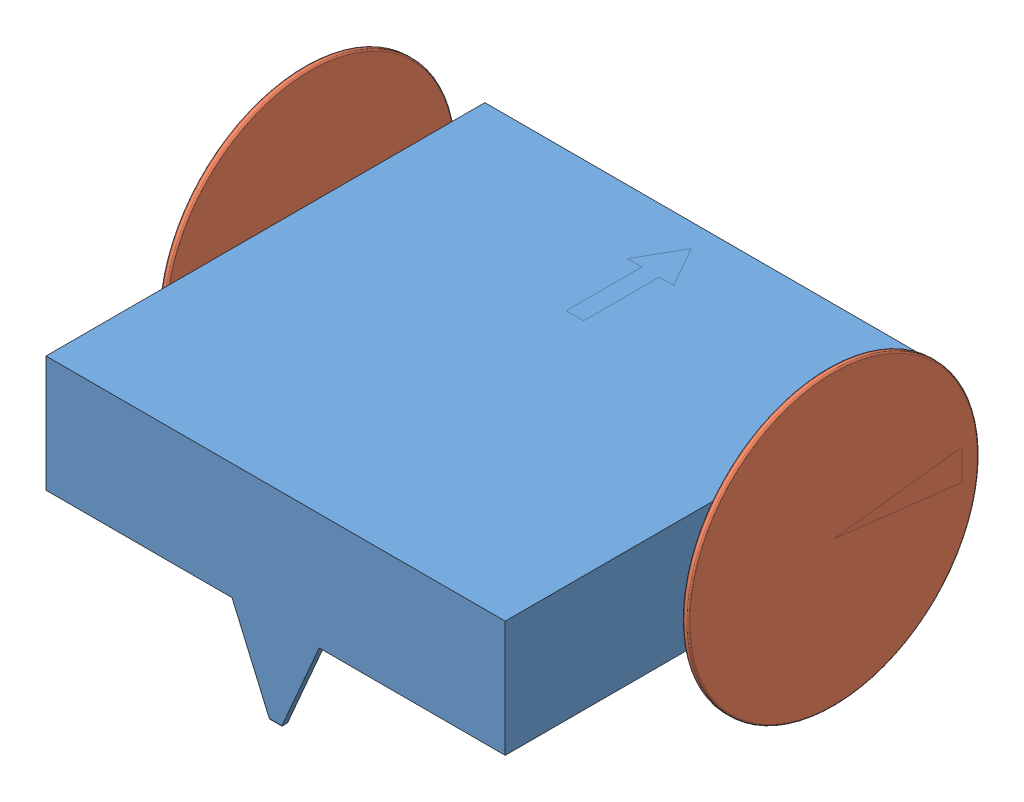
SolidWorks assembly PaperBot.SLDASM, configuration Default (file format 13000). Lengths in mm.
Overall size (91 50 75.5).
3 component instances, 2 part files, 3 mates.
Components (placement in the parent):
- PaperBase-1: PaperBase.SLDPRT [Default] at origin size (89 35 75.5)
- PaperWheels-1: PaperWheels.SLDPRT [Default] at (85 10 -50.5) x (0 1 0) z (0 0 1) size (50 1 50)
- PaperWheels-2: PaperWheels.SLDPRT [Default] at (-6 10 -50.5) x (0 -1 0) z (0 0 1) size (50 1 50)
Mates (geometry in assembly coordinates):
- Coincident2: coincident: point of PaperBase-1
- Hinge1: hinge anti-aligned: circle of PaperWheels-1; circle of PaperWheels-1; plane of PaperBase-1 through (84 10 -50.5) normal (-1 0 0); plane of PaperBase-1 through (84 10 -50.5) normal (1 0 0)
- Hinge2: hinge anti-aligned: circle of PaperWheels-2; circle of PaperWheels-2; plane of PaperBase-1 through (-5 10 -50.5) normal (1 0 0); plane of PaperBase-1 through (-5 20 0) normal (-1 0 0)
